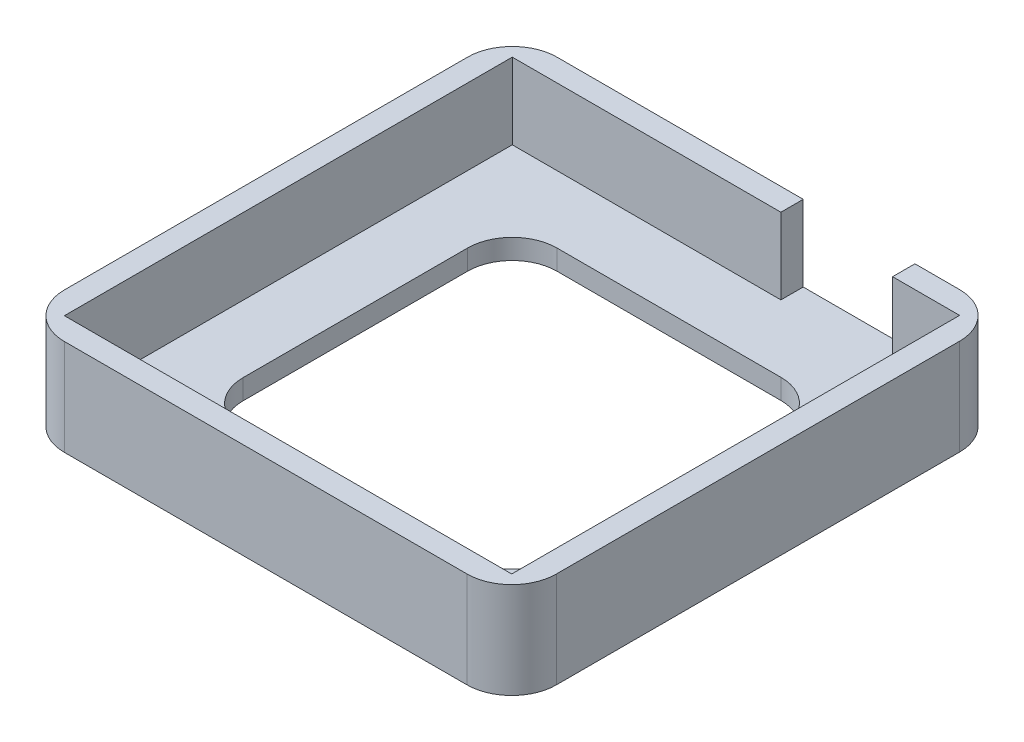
from build123d import *

# Parameters (mm, degrees)
SKETCH1_W           = 100.125
SKETCH1_H           = 21.5
BOSS_EXTRUDE1_DEPTH = 50.125
SKETCH2_W           = 50.0625
SKETCH2_H           = 100.25
CUT_EXTRUDE1_DEPTH  = 17
SKETCH2_3_W         = 110.125
SKETCH2_3_H         = 110.25
SKETCH2_3_W_2       = 100.125
SKETCH2_3_H_2       = 100.25
BOSS_EXTRUDE4_DEPTH = 21.5
SKETCH4_W           = 100.25
SKETCH4_H           = 4.5
BOSS_EXTRUDE2_DEPTH = 2
FILLET1_R           = 10
SKETCH8_W           = 70.125
SKETCH8_H           = 70.25
CUT_EXTRUDE2_DEPTH  = 80.747379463
FILLET2_R           = 10
SKETCH9_W           = 25
SKETCH9_H           = 17
CUT_EXTRUDE3_DEPTH  = 120.268620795


with BuildPart() as part:
    # Sketch1 → Boss-Extrude1 (new, symmetric)
    with BuildSketch(Plane.XY):
        Rectangle(SKETCH1_W, SKETCH1_H)
    extrude(amount=BOSS_EXTRUDE1_DEPTH, both=True)

    # Sketch2 → Cut-Extrude1 (cut)
    with BuildSketch(Plane(origin=(0, 10.75, 0), x_dir=(1, 0, 0), z_dir=(0, 1, 0))):
        with Locations((-25.03125, 0)):
            Rectangle(SKETCH2_W, SKETCH2_H)
        with Locations((25.03125, 0)):
            Rectangle(SKETCH2_W, SKETCH2_H)
    extrude(amount=-CUT_EXTRUDE1_DEPTH, mode=Mode.SUBTRACT)

    # Sketch2_3 → Boss-Extrude4 (add)
    with BuildSketch(Plane(origin=(0, 10.75, 0), x_dir=(1, 0, 0), z_dir=(0, 1, 0))):
        Rectangle(SKETCH2_3_W, SKETCH2_3_H)
        Rectangle(SKETCH2_3_W_2, SKETCH2_3_H_2, mode=Mode.SUBTRACT)
    extrude(amount=-BOSS_EXTRUDE4_DEPTH)

    # Sketch4 → Boss-Extrude2 (add)
    with BuildSketch(Plane(origin=(50.0625, 0, 0), x_dir=(0, 0, -1), z_dir=(1, 0, 0))):
        with Locations((0, -8.5)):
            Rectangle(SKETCH4_W, SKETCH4_H)
    boss_extrude2 = extrude(amount=BOSS_EXTRUDE2_DEPTH)

    # Mirror1: Boss-Extrude2 across plane
    add(boss_extrude2.mirror(Plane(origin=(0, 0, 0), x_dir=(0, 0, 1), z_dir=(1, 0, 0))))

    # Fillet1
    fillet1_edges = [part.edges().sort_by_distance(p)[0] for p in [
        (55.0625, 0, 55.125),
        (55.0625, 0, -55.125),
        (-55.0625, 0, -55.125),
        (-55.0625, 0, 55.125),
    ]]
    fillet(fillet1_edges, radius=FILLET1_R)

    # Sketch8 → Cut-Extrude2 (cut, through all)
    with BuildSketch(Plane(origin=(0, -6.25, 0), x_dir=(1, 0, 0), z_dir=(0, 1, 0))):
        Rectangle(SKETCH8_W, SKETCH8_H)
    extrude(amount=-CUT_EXTRUDE2_DEPTH, mode=Mode.SUBTRACT)

    # Fillet2
    fillet2_edges = [part.edges().sort_by_distance(p)[0] for p in [
        (-35.0625, -8.5, 35.125),
        (-35.0625, -8.5, -35.125),
        (35.0625, -8.5, -35.125),
        (35.0625, -8.5, 35.125),
    ]]
    fillet(fillet2_edges, radius=FILLET2_R)

    # Sketch9 → Cut-Extrude3 (cut, through all)
    with BuildSketch(Plane.XY.offset(-50.125)):
        with Locations((22.5625, 2.25)):
            Rectangle(SKETCH9_W, SKETCH9_H)
    extrude(amount=-CUT_EXTRUDE3_DEPTH, mode=Mode.SUBTRACT)


solid = part.part
